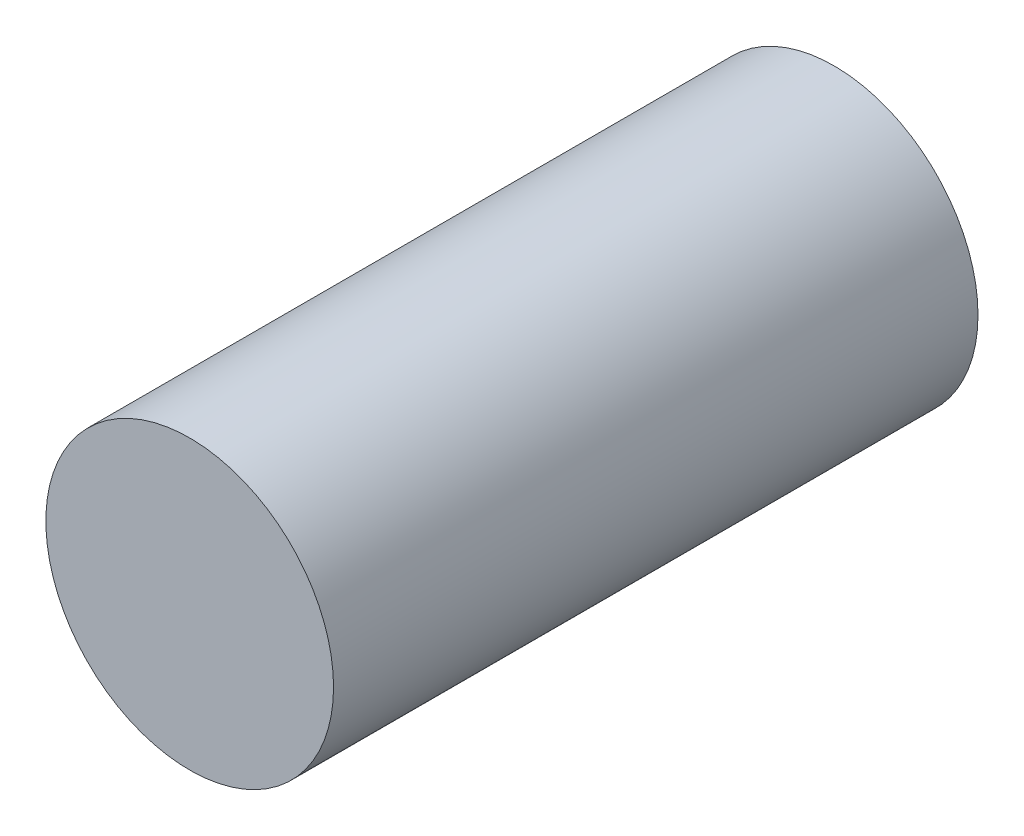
ISO-10303-21;
HEADER;
FILE_DESCRIPTION(('STEP AP214'),'2;1');
FILE_NAME('part.step','',(''),(''),'','','');
FILE_SCHEMA(('AUTOMOTIVE_DESIGN { 1 0 10303 214 1 1 1 1 }'));
ENDSEC;
DATA;
#1=APPLICATION_CONTEXT('core data for automotive mechanical design processes');
#2=APPLICATION_PROTOCOL_DEFINITION('international standard','automotive_design',2000,#1);
#3=PRODUCT_CONTEXT('',#1,'mechanical');
#4=PRODUCT('Part','Part','',(#3));
#5=PRODUCT_RELATED_PRODUCT_CATEGORY('part','',(#4));
#6=PRODUCT_DEFINITION_FORMATION('','',#4);
#7=PRODUCT_DEFINITION_CONTEXT('part definition',#1,'design');
#8=PRODUCT_DEFINITION('design','',#6,#7);
#9=PRODUCT_DEFINITION_SHAPE('','',#8);
#10=(LENGTH_UNIT() NAMED_UNIT(*) SI_UNIT(.MILLI.,.METRE.));
#11=(NAMED_UNIT(*) PLANE_ANGLE_UNIT() SI_UNIT($,.RADIAN.));
#12=(NAMED_UNIT(*) SI_UNIT($,.STERADIAN.) SOLID_ANGLE_UNIT());
#13=UNCERTAINTY_MEASURE_WITH_UNIT(LENGTH_MEASURE(1.E-05),#10,'distance_accuracy_value','');
#14=(GEOMETRIC_REPRESENTATION_CONTEXT(3) GLOBAL_UNCERTAINTY_ASSIGNED_CONTEXT((#13)) GLOBAL_UNIT_ASSIGNED_CONTEXT((#10,
#11,#12)) REPRESENTATION_CONTEXT('',''));
#15=CARTESIAN_POINT('',(0.,0.,0.));
#16=DIRECTION('',(0.,0.,1.));
#17=DIRECTION('',(1.,0.,0.));
#18=AXIS2_PLACEMENT_3D('',#15,#16,#17);
#19=CARTESIAN_POINT('',(0.,0.,-112.));
#20=DIRECTION('',(0.,0.,1.));
#21=DIRECTION('',(1.,0.,0.));
#22=AXIS2_PLACEMENT_3D('',#19,#20,#21);
#23=CYLINDRICAL_SURFACE('',#22,25.);
#24=CARTESIAN_POINT('',(0.,0.,-112.));
#25=DIRECTION('',(0.,0.,1.));
#26=DIRECTION('',(1.,0.,0.));
#27=AXIS2_PLACEMENT_3D('',#24,#25,#26);
#28=CIRCLE('',#27,25.);
#29=CARTESIAN_POINT('',(25.,0.,-112.));
#30=VERTEX_POINT('',#29);
#31=EDGE_CURVE('E10',#30,#30,#28,.T.);
#32=ORIENTED_EDGE('',*,*,#31,.T.);
#33=EDGE_LOOP('',(#32));
#34=FACE_BOUND('',#33,.T.);
#35=CARTESIAN_POINT('',(0.,0.,0.));
#36=DIRECTION('',(0.,0.,1.));
#37=DIRECTION('',(1.,0.,0.));
#38=AXIS2_PLACEMENT_3D('',#35,#36,#37);
#39=CIRCLE('',#38,25.);
#40=CARTESIAN_POINT('',(25.,0.,0.));
#41=VERTEX_POINT('',#40);
#42=EDGE_CURVE('E32',#41,#41,#39,.T.);
#43=ORIENTED_EDGE('',*,*,#42,.F.);
#44=EDGE_LOOP('',(#43));
#45=FACE_BOUND('',#44,.T.);
#46=ADVANCED_FACE('F29',(#34,#45),#23,.T.);
#47=CARTESIAN_POINT('',(0.,0.,-112.));
#48=DIRECTION('',(0.,0.,1.));
#49=DIRECTION('',(1.,0.,0.));
#50=AXIS2_PLACEMENT_3D('',#47,#48,#49);
#51=PLANE('',#50);
#52=ORIENTED_EDGE('',*,*,#31,.F.);
#53=EDGE_LOOP('',(#52));
#54=FACE_BOUND('',#53,.T.);
#55=ADVANCED_FACE('F44',(#54),#51,.F.);
#56=CARTESIAN_POINT('',(0.,0.,0.));
#57=DIRECTION('',(0.,0.,1.));
#58=DIRECTION('',(1.,0.,0.));
#59=AXIS2_PLACEMENT_3D('',#56,#57,#58);
#60=PLANE('',#59);
#61=ORIENTED_EDGE('',*,*,#42,.T.);
#62=EDGE_LOOP('',(#61));
#63=FACE_BOUND('',#62,.T.);
#64=ADVANCED_FACE('F41',(#63),#60,.T.);
#65=CLOSED_SHELL('',(#46,#55,#64));
#66=MANIFOLD_SOLID_BREP('B2',#65);
#67=ADVANCED_BREP_SHAPE_REPRESENTATION('',(#18,#66),#14);
#68=SHAPE_DEFINITION_REPRESENTATION(#9,#67);
ENDSEC;
END-ISO-10303-21;
